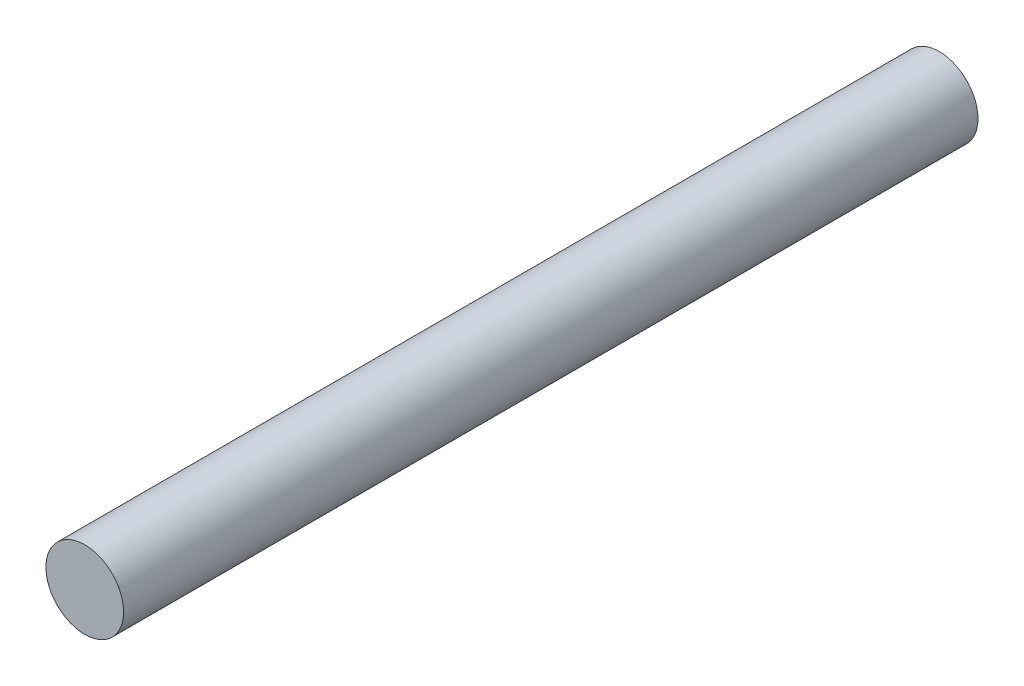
ISO-10303-21;
HEADER;
FILE_DESCRIPTION(('STEP AP214'),'2;1');
FILE_NAME('part.step','',(''),(''),'','','');
FILE_SCHEMA(('AUTOMOTIVE_DESIGN { 1 0 10303 214 1 1 1 1 }'));
ENDSEC;
DATA;
#1=APPLICATION_CONTEXT('core data for automotive mechanical design processes');
#2=APPLICATION_PROTOCOL_DEFINITION('international standard','automotive_design',2000,#1);
#3=PRODUCT_CONTEXT('',#1,'mechanical');
#4=PRODUCT('Part','Part','',(#3));
#5=PRODUCT_RELATED_PRODUCT_CATEGORY('part','',(#4));
#6=PRODUCT_DEFINITION_FORMATION('','',#4);
#7=PRODUCT_DEFINITION_CONTEXT('part definition',#1,'design');
#8=PRODUCT_DEFINITION('design','',#6,#7);
#9=PRODUCT_DEFINITION_SHAPE('','',#8);
#10=(LENGTH_UNIT() NAMED_UNIT(*) SI_UNIT(.MILLI.,.METRE.));
#11=(NAMED_UNIT(*) PLANE_ANGLE_UNIT() SI_UNIT($,.RADIAN.));
#12=(NAMED_UNIT(*) SI_UNIT($,.STERADIAN.) SOLID_ANGLE_UNIT());
#13=UNCERTAINTY_MEASURE_WITH_UNIT(LENGTH_MEASURE(1.E-05),#10,'distance_accuracy_value','');
#14=(GEOMETRIC_REPRESENTATION_CONTEXT(3) GLOBAL_UNCERTAINTY_ASSIGNED_CONTEXT((#13)) GLOBAL_UNIT_ASSIGNED_CONTEXT((#10,
#11,#12)) REPRESENTATION_CONTEXT('',''));
#15=CARTESIAN_POINT('',(0.,0.,0.));
#16=DIRECTION('',(0.,0.,1.));
#17=DIRECTION('',(1.,0.,0.));
#18=AXIS2_PLACEMENT_3D('',#15,#16,#17);
#19=CARTESIAN_POINT('',(0.,0.,22.));
#20=DIRECTION('',(0.,0.,-1.));
#21=DIRECTION('',(-1.,0.,0.));
#22=AXIS2_PLACEMENT_3D('',#19,#20,#21);
#23=CYLINDRICAL_SURFACE('',#22,1.);
#24=CARTESIAN_POINT('',(0.,0.,22.));
#25=DIRECTION('',(0.,0.,1.));
#26=DIRECTION('',(1.,0.,0.));
#27=AXIS2_PLACEMENT_3D('',#24,#25,#26);
#28=CIRCLE('',#27,1.);
#29=CARTESIAN_POINT('',(1.,0.,22.));
#30=VERTEX_POINT('',#29);
#31=EDGE_CURVE('E10',#30,#30,#28,.T.);
#32=ORIENTED_EDGE('',*,*,#31,.F.);
#33=EDGE_LOOP('',(#32));
#34=FACE_BOUND('',#33,.T.);
#35=CARTESIAN_POINT('',(0.,0.,0.));
#36=DIRECTION('',(0.,0.,1.));
#37=DIRECTION('',(1.,0.,0.));
#38=AXIS2_PLACEMENT_3D('',#35,#36,#37);
#39=CIRCLE('',#38,1.);
#40=CARTESIAN_POINT('',(1.,0.,0.));
#41=VERTEX_POINT('',#40);
#42=EDGE_CURVE('E35',#41,#41,#39,.T.);
#43=ORIENTED_EDGE('',*,*,#42,.T.);
#44=EDGE_LOOP('',(#43));
#45=FACE_BOUND('',#44,.T.);
#46=ADVANCED_FACE('F32',(#34,#45),#23,.T.);
#47=CARTESIAN_POINT('',(0.,0.,22.));
#48=DIRECTION('',(0.,0.,1.));
#49=DIRECTION('',(1.,0.,0.));
#50=AXIS2_PLACEMENT_3D('',#47,#48,#49);
#51=PLANE('',#50);
#52=ORIENTED_EDGE('',*,*,#31,.T.);
#53=EDGE_LOOP('',(#52));
#54=FACE_BOUND('',#53,.T.);
#55=ADVANCED_FACE('F47',(#54),#51,.T.);
#56=CARTESIAN_POINT('',(0.,0.,0.));
#57=DIRECTION('',(0.,0.,1.));
#58=DIRECTION('',(1.,0.,0.));
#59=AXIS2_PLACEMENT_3D('',#56,#57,#58);
#60=PLANE('',#59);
#61=ORIENTED_EDGE('',*,*,#42,.F.);
#62=EDGE_LOOP('',(#61));
#63=FACE_BOUND('',#62,.T.);
#64=ADVANCED_FACE('F45',(#63),#60,.F.);
#65=CLOSED_SHELL('',(#46,#55,#64));
#66=MANIFOLD_SOLID_BREP('B2',#65);
#67=ADVANCED_BREP_SHAPE_REPRESENTATION('',(#18,#66),#14);
#68=SHAPE_DEFINITION_REPRESENTATION(#9,#67);
ENDSEC;
END-ISO-10303-21;
